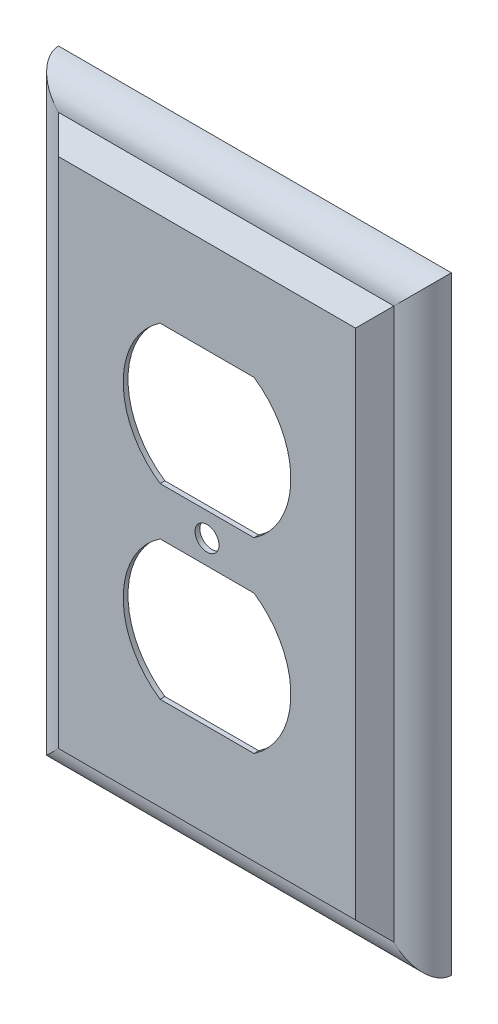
from build123d import *

# Parameters (mm, degrees)
SKETCH1_W          = 70
SKETCH1_H          = 115
BASE_EXTRUDE_DEPTH = 10
CHAMFER2_SIZE      = 4
SHELL1_T           = -1
OUTLETCUT_DEPTH    = 136
SKETCH5_R          = 2.5
SCREWHOLE_DEPTH    = 136


with BuildPart() as part:
    # Sketch1 → Base-Extrude (new body)
    with BuildSketch(Plane.XY):
        with Locations((35, 57.5)):
            Rectangle(SKETCH1_W, SKETCH1_H)
    extrude(amount=BASE_EXTRUDE_DEPTH)

    # Chamfer2
    chamfer2_edges = [part.edges().sort_by_distance(p)[0] for p in [
        (70, 57.5, 10),
        (35, 115, 10),
        (0, 57.5, 10),
        (35, 0, 10),
    ]]
    chamfer(chamfer2_edges, length=CHAMFER2_SIZE)

    # Shell1
    shell1_openings = [part.faces().sort_by_distance(p)[0] for p in [
        (35, 57.5, 0),
    ]]
    offset(amount=SHELL1_T, openings=shell1_openings, kind=Kind.INTERSECTION)

    # Sketch4 → outletcut (cut, through all)
    with BuildSketch(Plane(origin=(0, 0, 0), x_dir=(-1, 0, 0), z_dir=(0, 0, -1))):
        with BuildLine():
            Line((-25.202041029, 91.5), (-44.797958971, 91.5))
            ThreePointArc((-44.797958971, 91.5), (-52.5, 77), (-44.797958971, 62.5))
            Line((-44.797958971, 62.5), (-25.202041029, 62.5))
            ThreePointArc((-25.202041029, 62.5), (-17.5, 77), (-25.202041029, 91.5))
        make_face()
        with BuildLine():
            Line((-25.202041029, 52.5), (-44.797958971, 52.5))
            ThreePointArc((-44.797958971, 52.5), (-52.5, 38), (-44.797958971, 23.5))
            Line((-44.797958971, 23.5), (-25.202041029, 23.5))
            ThreePointArc((-25.202041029, 23.5), (-17.5, 38), (-25.202041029, 52.5))
        make_face()
    extrude(amount=-OUTLETCUT_DEPTH, mode=Mode.SUBTRACT)

    # Sketch5 → screwhole (cut, through all)
    with BuildSketch(Plane.XY.offset(10)):
        with Locations((35, 57.5)):
            Circle(SKETCH5_R)
    extrude(amount=-SCREWHOLE_DEPTH, mode=Mode.SUBTRACT)

    # Boss-Sweep1: sweep along a path in Sketch7
    with BuildLine(Plane(origin=(0, 0, 0), x_dir=(-1, 0, 0), z_dir=(0, 0, -1))) as boss_sweep1_path:
        Line((0, 0), (0, 115))
        Line((0, 115), (-70, 115))
        Line((-70, 115), (-70, 0))
        Line((-70, 0), (0, 0))
    # Sketch6 → Boss-Sweep1 (sweep)
    with BuildSketch(Plane.XZ.offset(-115)):
        with BuildLine():
            Line((70, 6), (70, 0))
            Line((70, 0), (76, 0))
            ThreePointArc((76, 0), (74.242640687, 4.242640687), (70, 6))
        make_face()
    sweep(path=boss_sweep1_path.line, transition=Transition.RIGHT)


solid = part.part
